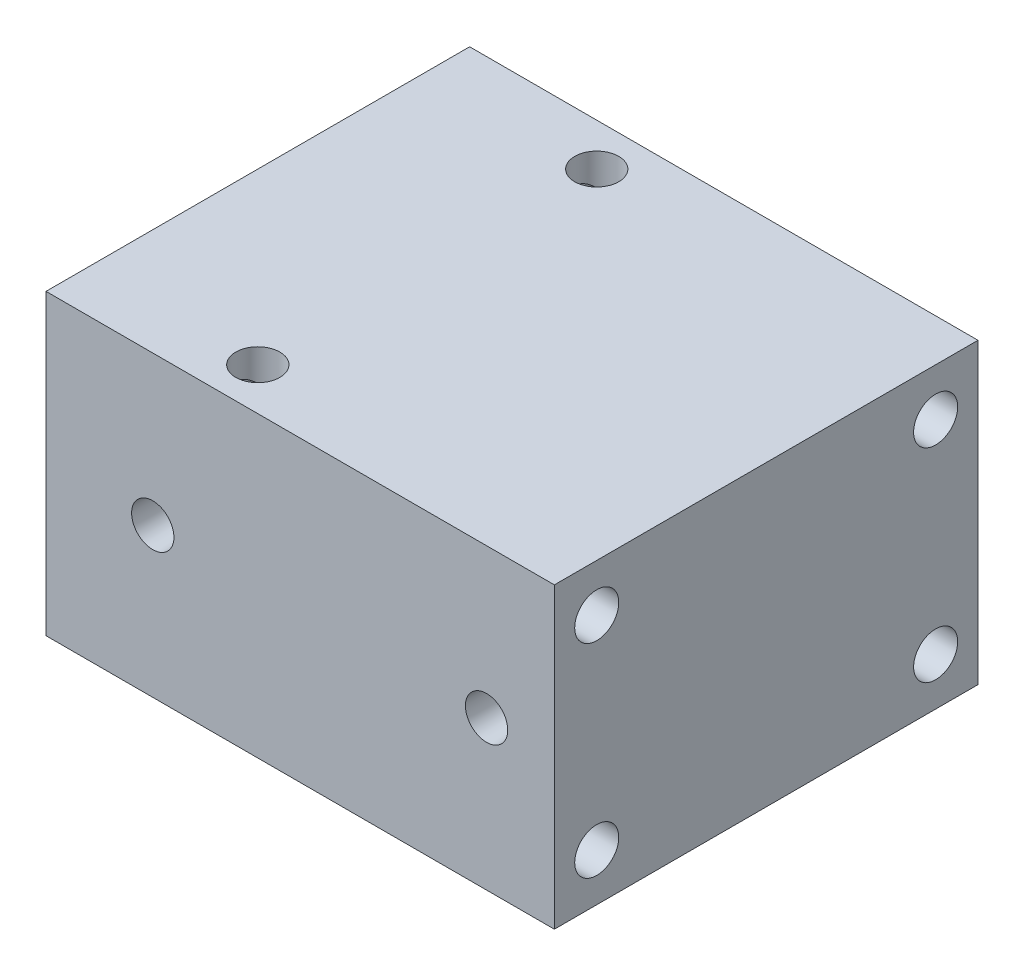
from build123d import *

# Parameters (mm, degrees)
SKETCH1_W                         = 150
SKETCH1_H                         = 125
SKETCH1_R                         = 6.5
EXTRUDE_H1_DEPTH                  = 88
SKETCH2_R                         = 1.5
CENTER_HOLE_DEPTH                 = 60
F_1_4_NPT_TAPPED_HOLE1_AT_2_COUNT = 2
F_1_4_NPT_TAPPED_HOLE1_AT_2_PITCH = 98.5
MTG_HOLE_REACH                    = 186.798
SKETCH6_R                         = 6.5
SKETCH5_R                         = 2
OIL_HOLE_DEPTH                    = 20


with BuildPart() as part:
    # Sketch1 → Extrude H1 (new body)
    with BuildSketch(Plane(origin=(0, 0, 0), x_dir=(1, 0, 0), z_dir=(0, 1, 0))):
        Rectangle(SKETCH1_W, SKETCH1_H)
        with Locations(Location((-25, 50, 0), (0, 0, 270))):
            Circle(SKETCH1_R, mode=Mode.SUBTRACT)
        with Locations(Location((-25, -50, 0), (0, 0, 270))):
            Circle(SKETCH1_R, mode=Mode.SUBTRACT)
    extrude(amount=EXTRUDE_H1_DEPTH)

    # Sketch2 → CENTER HOLE (cut)
    with BuildSketch(Plane.ZY.offset(75)):
        with Locations((0, 44)):
            Circle(SKETCH2_R)
    extrude(amount=-CENTER_HOLE_DEPTH, mode=Mode.SUBTRACT)

    # Sketch3 → 1_4 NPT Tapped Hole1 (revolve, cut)
    with BuildSketch(Plane(origin=(55, 44, 62.5), x_dir=(0, -1, 0), z_dir=(1, 0, 0))):
        Polygon((0, 0), (0, 20.412347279), (5.5626, 17.07), (5.5626, 10.02), (5.943676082, 10.02), (6.2436883, 0), align=None)
    f_1_4_npt_tapped_hole1 = revolve(axis=Axis((55, 44, 68.85), (0, 0, -1)), mode=Mode.SUBTRACT)

    # 1_4 NPT Tapped Hole1 at 2: 1_4 NPT Tapped Hole1 ×2
    with Locations(*[(-i * F_1_4_NPT_TAPPED_HOLE1_AT_2_PITCH, 0, 0) for i in range(1, F_1_4_NPT_TAPPED_HOLE1_AT_2_COUNT)]):
        add(f_1_4_npt_tapped_hole1, mode=Mode.SUBTRACT)

    # MTG HOLE: up to this face of the body (flat: up to its plane)
    mtg_hole_end = Plane(part.part.faces().sort_by_distance((75, 44, 0))[0])
    # Sketch6 → MTG HOLE (cut, up to the picked face)
    with BuildSketch(Plane.ZY.offset(75), mode=Mode.PRIVATE) as mtg_hole_sk1:
        with Locations((-50, 74)):
            Circle(SKETCH6_R)
    mtg_hole_tool1 = split(extrude(mtg_hole_sk1.sketch, amount=-MTG_HOLE_REACH, mode=Mode.PRIVATE), bisect_by=mtg_hole_end, keep=Keep.BOTH, mode=Mode.PRIVATE)
    # Sketch6 → MTG HOLE (cut, up to the picked face)
    with BuildSketch(Plane.ZY.offset(75), mode=Mode.PRIVATE) as mtg_hole_sk2:
        with Locations((-50, 14)):
            Circle(SKETCH6_R)
    mtg_hole_tool2 = split(extrude(mtg_hole_sk2.sketch, amount=-MTG_HOLE_REACH, mode=Mode.PRIVATE), bisect_by=mtg_hole_end, keep=Keep.BOTH, mode=Mode.PRIVATE)
    # Sketch6 → MTG HOLE (cut, up to the picked face)
    with BuildSketch(Plane.ZY.offset(75), mode=Mode.PRIVATE) as mtg_hole_sk3:
        with Locations((50, 74)):
            Circle(SKETCH6_R)
    mtg_hole_tool3 = split(extrude(mtg_hole_sk3.sketch, amount=-MTG_HOLE_REACH, mode=Mode.PRIVATE), bisect_by=mtg_hole_end, keep=Keep.BOTH, mode=Mode.PRIVATE)
    # Sketch6 → MTG HOLE (cut, up to the picked face)
    with BuildSketch(Plane.ZY.offset(75), mode=Mode.PRIVATE) as mtg_hole_sk4:
        with Locations((50, 14)):
            Circle(SKETCH6_R)
    mtg_hole_tool4 = split(extrude(mtg_hole_sk4.sketch, amount=-MTG_HOLE_REACH, mode=Mode.PRIVATE), bisect_by=mtg_hole_end, keep=Keep.BOTH, mode=Mode.PRIVATE)
    add(mtg_hole_tool1.solids().sort_by(Axis((-75, 74, -50), (1, 0, 0)))[0], mode=Mode.SUBTRACT)
    add(mtg_hole_tool2.solids().sort_by(Axis((-75, 14, -50), (1, 0, 0)))[0], mode=Mode.SUBTRACT)
    add(mtg_hole_tool3.solids().sort_by(Axis((-75, 74, 50), (1, 0, 0)))[0], mode=Mode.SUBTRACT)
    add(mtg_hole_tool4.solids().sort_by(Axis((-75, 14, 50), (1, 0, 0)))[0], mode=Mode.SUBTRACT)

    # Sketch5 → OIL HOLE (cut)
    with BuildSketch(Plane.XY.offset(62.5)):
        with Locations((-43.5, 44)):
            Circle(SKETCH5_R)
        with Locations((55, 44)):
            Circle(SKETCH5_R)
    extrude(amount=-OIL_HOLE_DEPTH, mode=Mode.SUBTRACT)


solid = part.part
